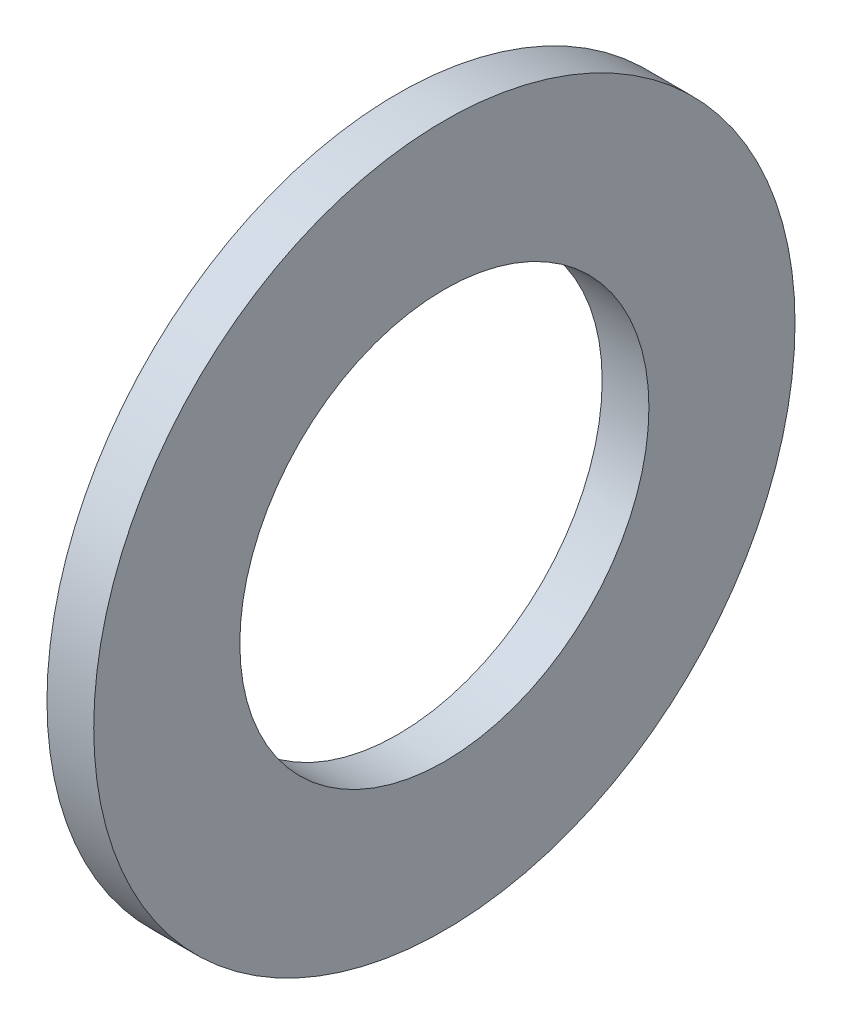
from build123d import *

# Parameters (mm, degrees)
ESQUISSE1_W = 0.4
ESQUISSE1_H = 1.25


with BuildPart() as part:
    # Esquisse1 → Base-R_volution (revolve)
    with BuildSketch(Plane.XY, mode=Mode.PRIVATE) as base_r_volution_sk:
        with Locations((0.2, 2.375)):
            Rectangle(ESQUISSE1_W, ESQUISSE1_H)
    revolve(base_r_volution_sk.sketch.rotate(Axis((0, 0, 0), (1, 0, 0)), 90), axis=Axis((0, 0, 0), (1, 0, 0)))


solid = part.part
